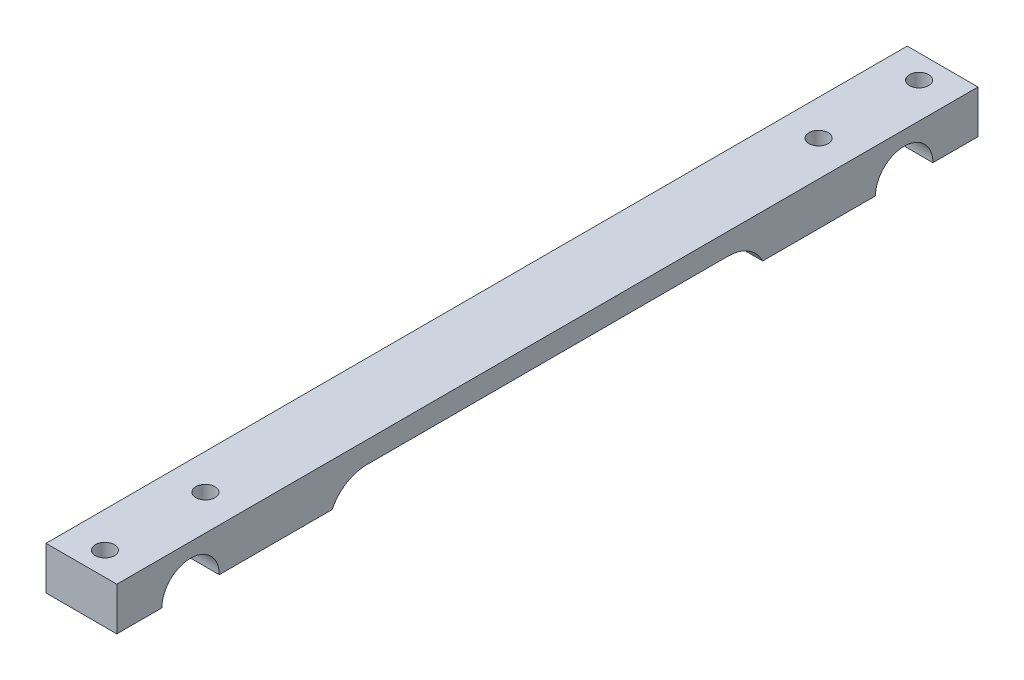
ISO-10303-21;
HEADER;
FILE_DESCRIPTION(('STEP AP214'),'2;1');
FILE_NAME('part.step','',(''),(''),'','','');
FILE_SCHEMA(('AUTOMOTIVE_DESIGN { 1 0 10303 214 1 1 1 1 }'));
ENDSEC;
DATA;
#1=APPLICATION_CONTEXT('core data for automotive mechanical design processes');
#2=APPLICATION_PROTOCOL_DEFINITION('international standard','automotive_design',2000,#1);
#3=PRODUCT_CONTEXT('',#1,'mechanical');
#4=PRODUCT('Part','Part','',(#3));
#5=PRODUCT_RELATED_PRODUCT_CATEGORY('part','',(#4));
#6=PRODUCT_DEFINITION_FORMATION('','',#4);
#7=PRODUCT_DEFINITION_CONTEXT('part definition',#1,'design');
#8=PRODUCT_DEFINITION('design','',#6,#7);
#9=PRODUCT_DEFINITION_SHAPE('','',#8);
#10=(LENGTH_UNIT() NAMED_UNIT(*) SI_UNIT(.MILLI.,.METRE.));
#11=(NAMED_UNIT(*) PLANE_ANGLE_UNIT() SI_UNIT($,.RADIAN.));
#12=(NAMED_UNIT(*) SI_UNIT($,.STERADIAN.) SOLID_ANGLE_UNIT());
#13=UNCERTAINTY_MEASURE_WITH_UNIT(LENGTH_MEASURE(1.E-05),#10,'distance_accuracy_value','');
#14=(GEOMETRIC_REPRESENTATION_CONTEXT(3) GLOBAL_UNCERTAINTY_ASSIGNED_CONTEXT((#13)) GLOBAL_UNIT_ASSIGNED_CONTEXT((#10,
#11,#12)) REPRESENTATION_CONTEXT('',''));
#15=CARTESIAN_POINT('',(0.,0.,0.));
#16=DIRECTION('',(0.,0.,1.));
#17=DIRECTION('',(1.,0.,0.));
#18=AXIS2_PLACEMENT_3D('',#15,#16,#17);
#19=CARTESIAN_POINT('',(14.8,-4.5,90.));
#20=DIRECTION('',(0.,1.,0.));
#21=DIRECTION('',(0.,0.,1.));
#22=AXIS2_PLACEMENT_3D('',#19,#20,#21);
#23=PLANE('',#22);
#24=CARTESIAN_POINT('',(7.40000000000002,-4.5,64.079));
#25=DIRECTION('',(0.,1.,0.));
#26=DIRECTION('',(0.,0.,1.));
#27=AXIS2_PLACEMENT_3D('',#24,#25,#26);
#28=CIRCLE('',#27,2.);
#29=CARTESIAN_POINT('',(7.40000000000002,-4.5,66.079));
#30=VERTEX_POINT('',#29);
#31=EDGE_CURVE('E153',#30,#30,#28,.T.);
#32=ORIENTED_EDGE('',*,*,#31,.T.);
#33=EDGE_LOOP('',(#32));
#34=FACE_BOUND('',#33,.T.);
#35=DIRECTION('',(0.,0.,-1.));
#36=VECTOR('',#35,1.);
#37=CARTESIAN_POINT('',(0.,-4.5,90.));
#38=LINE('',#37,#36);
#39=CARTESIAN_POINT('',(0.,-4.5,68.579));
#40=VERTEX_POINT('',#39);
#41=CARTESIAN_POINT('',(0.,-4.5,45.));
#42=VERTEX_POINT('',#41);
#43=EDGE_CURVE('E129',#40,#42,#38,.T.);
#44=ORIENTED_EDGE('',*,*,#43,.T.);
#45=DIRECTION('',(1.,0.,0.));
#46=VECTOR('',#45,1.);
#47=CARTESIAN_POINT('',(0.,-4.5,45.));
#48=LINE('',#47,#46);
#49=CARTESIAN_POINT('',(14.8,-4.5,45.));
#50=VERTEX_POINT('',#49);
#51=EDGE_CURVE('E137',#42,#50,#48,.T.);
#52=ORIENTED_EDGE('',*,*,#51,.T.);
#53=DIRECTION('',(0.,0.,-1.));
#54=VECTOR('',#53,1.);
#55=CARTESIAN_POINT('',(14.8,-4.5,90.));
#56=LINE('',#55,#54);
#57=CARTESIAN_POINT('',(14.8,-4.5,68.579));
#58=VERTEX_POINT('',#57);
#59=EDGE_CURVE('E208',#58,#50,#56,.T.);
#60=ORIENTED_EDGE('',*,*,#59,.F.);
#61=DIRECTION('',(1.,0.,0.));
#62=VECTOR('',#61,1.);
#63=CARTESIAN_POINT('',(0.,-4.5,68.579));
#64=LINE('',#63,#62);
#65=EDGE_CURVE('E139',#40,#58,#64,.T.);
#66=ORIENTED_EDGE('',*,*,#65,.F.);
#67=EDGE_LOOP('',(#44,#52,#60,#66));
#68=FACE_BOUND('',#67,.T.);
#69=ADVANCED_FACE('F37',(#34,#68),#23,.F.);
#70=CARTESIAN_POINT('',(7.40000000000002,-4.5,85.079));
#71=DIRECTION('',(0.,1.,0.));
#72=DIRECTION('',(0.,0.,1.));
#73=AXIS2_PLACEMENT_3D('',#70,#71,#72);
#74=CIRCLE('',#73,2.);
#75=CARTESIAN_POINT('',(7.40000000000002,-4.5,87.079));
#76=VERTEX_POINT('',#75);
#77=EDGE_CURVE('E160',#76,#76,#74,.T.);
#78=ORIENTED_EDGE('',*,*,#77,.T.);
#79=EDGE_LOOP('',(#78));
#80=FACE_BOUND('',#79,.T.);
#81=CARTESIAN_POINT('',(0.,-4.5,90.));
#82=VERTEX_POINT('',#81);
#83=CARTESIAN_POINT('',(0.,-4.5,80.579));
#84=VERTEX_POINT('',#83);
#85=EDGE_CURVE('E140',#82,#84,#38,.T.);
#86=ORIENTED_EDGE('',*,*,#85,.T.);
#87=DIRECTION('',(1.,0.,0.));
#88=VECTOR('',#87,1.);
#89=CARTESIAN_POINT('',(0.,-4.5,80.579));
#90=LINE('',#89,#88);
#91=CARTESIAN_POINT('',(14.8,-4.5,80.579));
#92=VERTEX_POINT('',#91);
#93=EDGE_CURVE('E182',#84,#92,#90,.T.);
#94=ORIENTED_EDGE('',*,*,#93,.T.);
#95=CARTESIAN_POINT('',(14.8,-4.5,90.));
#96=VERTEX_POINT('',#95);
#97=EDGE_CURVE('E204',#96,#92,#56,.T.);
#98=ORIENTED_EDGE('',*,*,#97,.F.);
#99=DIRECTION('',(-1.,0.,0.));
#100=VECTOR('',#99,1.);
#101=CARTESIAN_POINT('',(14.8,-4.5,90.));
#102=LINE('',#101,#100);
#103=EDGE_CURVE('E219',#96,#82,#102,.T.);
#104=ORIENTED_EDGE('',*,*,#103,.T.);
#105=EDGE_LOOP('',(#86,#94,#98,#104));
#106=FACE_BOUND('',#105,.T.);
#107=ADVANCED_FACE('F269',(#80,#106),#23,.F.);
#108=CARTESIAN_POINT('',(7.40000000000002,-4.5,-64.079));
#109=DIRECTION('',(0.,1.,0.));
#110=DIRECTION('',(0.,0.,1.));
#111=AXIS2_PLACEMENT_3D('',#108,#109,#110);
#112=CIRCLE('',#111,2.);
#113=CARTESIAN_POINT('',(7.40000000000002,-4.5,-62.079));
#114=VERTEX_POINT('',#113);
#115=EDGE_CURVE('E171',#114,#114,#112,.T.);
#116=ORIENTED_EDGE('',*,*,#115,.T.);
#117=EDGE_LOOP('',(#116));
#118=FACE_BOUND('',#117,.T.);
#119=CARTESIAN_POINT('',(14.8,-4.49999999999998,-45.));
#120=VERTEX_POINT('',#119);
#121=CARTESIAN_POINT('',(14.8,-4.5,-68.579));
#122=VERTEX_POINT('',#121);
#123=EDGE_CURVE('E209',#120,#122,#56,.T.);
#124=ORIENTED_EDGE('',*,*,#123,.F.);
#125=DIRECTION('',(1.,0.,0.));
#126=VECTOR('',#125,1.);
#127=CARTESIAN_POINT('',(0.,-4.49999999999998,-45.));
#128=LINE('',#127,#126);
#129=CARTESIAN_POINT('',(0.,-4.49999999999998,-45.));
#130=VERTEX_POINT('',#129);
#131=EDGE_CURVE('E144',#130,#120,#128,.T.);
#132=ORIENTED_EDGE('',*,*,#131,.F.);
#133=CARTESIAN_POINT('',(0.,-4.5,-68.579));
#134=VERTEX_POINT('',#133);
#135=EDGE_CURVE('E141',#130,#134,#38,.T.);
#136=ORIENTED_EDGE('',*,*,#135,.T.);
#137=DIRECTION('',(1.,0.,0.));
#138=VECTOR('',#137,1.);
#139=CARTESIAN_POINT('',(0.,-4.5,-68.579));
#140=LINE('',#139,#138);
#141=EDGE_CURVE('E174',#134,#122,#140,.T.);
#142=ORIENTED_EDGE('',*,*,#141,.T.);
#143=EDGE_LOOP('',(#124,#132,#136,#142));
#144=FACE_BOUND('',#143,.T.);
#145=ADVANCED_FACE('F245',(#118,#144),#23,.F.);
#146=CARTESIAN_POINT('',(14.8,-4.5,-90.));
#147=DIRECTION('',(0.,0.,1.));
#148=DIRECTION('',(1.,0.,0.));
#149=AXIS2_PLACEMENT_3D('',#146,#147,#148);
#150=PLANE('',#149);
#151=DIRECTION('',(0.,1.,0.));
#152=VECTOR('',#151,1.);
#153=CARTESIAN_POINT('',(0.,-4.5,-90.));
#154=LINE('',#153,#152);
#155=CARTESIAN_POINT('',(0.,-4.5,-90.));
#156=VERTEX_POINT('',#155);
#157=CARTESIAN_POINT('',(0.,4.5,-90.));
#158=VERTEX_POINT('',#157);
#159=EDGE_CURVE('E185',#156,#158,#154,.T.);
#160=ORIENTED_EDGE('',*,*,#159,.T.);
#161=DIRECTION('',(-1.,0.,0.));
#162=VECTOR('',#161,1.);
#163=CARTESIAN_POINT('',(14.8,4.5,-90.));
#164=LINE('',#163,#162);
#165=CARTESIAN_POINT('',(14.8,4.5,-90.));
#166=VERTEX_POINT('',#165);
#167=EDGE_CURVE('E225',#166,#158,#164,.T.);
#168=ORIENTED_EDGE('',*,*,#167,.F.);
#169=DIRECTION('',(0.,1.,0.));
#170=VECTOR('',#169,1.);
#171=CARTESIAN_POINT('',(14.8,-4.5,-90.));
#172=LINE('',#171,#170);
#173=CARTESIAN_POINT('',(14.8,-4.5,-90.));
#174=VERTEX_POINT('',#173);
#175=EDGE_CURVE('E196',#174,#166,#172,.T.);
#176=ORIENTED_EDGE('',*,*,#175,.F.);
#177=DIRECTION('',(-1.,0.,0.));
#178=VECTOR('',#177,1.);
#179=CARTESIAN_POINT('',(14.8,-4.5,-90.));
#180=LINE('',#179,#178);
#181=EDGE_CURVE('E207',#174,#156,#180,.T.);
#182=ORIENTED_EDGE('',*,*,#181,.T.);
#183=EDGE_LOOP('',(#160,#168,#176,#182));
#184=FACE_BOUND('',#183,.T.);
#185=ADVANCED_FACE('F257',(#184),#150,.F.);
#186=CARTESIAN_POINT('',(14.8,4.5,90.));
#187=DIRECTION('',(0.,-1.,0.));
#188=DIRECTION('',(0.,0.,-1.));
#189=AXIS2_PLACEMENT_3D('',#186,#187,#188);
#190=PLANE('',#189);
#191=CARTESIAN_POINT('',(7.40000000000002,4.5,-85.079));
#192=DIRECTION('',(0.,1.,0.));
#193=DIRECTION('',(0.,0.,1.));
#194=AXIS2_PLACEMENT_3D('',#191,#192,#193);
#195=CIRCLE('',#194,2.);
#196=CARTESIAN_POINT('',(7.40000000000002,4.5,-83.079));
#197=VERTEX_POINT('',#196);
#198=EDGE_CURVE('E147',#197,#197,#195,.T.);
#199=ORIENTED_EDGE('',*,*,#198,.F.);
#200=EDGE_LOOP('',(#199));
#201=FACE_BOUND('',#200,.T.);
#202=CARTESIAN_POINT('',(7.40000000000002,4.5,85.079));
#203=DIRECTION('',(0.,1.,0.));
#204=DIRECTION('',(0.,0.,1.));
#205=AXIS2_PLACEMENT_3D('',#202,#203,#204);
#206=CIRCLE('',#205,2.);
#207=CARTESIAN_POINT('',(7.40000000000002,4.5,87.079));
#208=VERTEX_POINT('',#207);
#209=EDGE_CURVE('E163',#208,#208,#206,.T.);
#210=ORIENTED_EDGE('',*,*,#209,.F.);
#211=EDGE_LOOP('',(#210));
#212=FACE_BOUND('',#211,.T.);
#213=CARTESIAN_POINT('',(7.40000000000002,4.5,64.079));
#214=DIRECTION('',(0.,1.,0.));
#215=DIRECTION('',(0.,0.,1.));
#216=AXIS2_PLACEMENT_3D('',#213,#214,#215);
#217=CIRCLE('',#216,2.);
#218=CARTESIAN_POINT('',(7.40000000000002,4.5,66.079));
#219=VERTEX_POINT('',#218);
#220=EDGE_CURVE('E157',#219,#219,#217,.T.);
#221=ORIENTED_EDGE('',*,*,#220,.F.);
#222=EDGE_LOOP('',(#221));
#223=FACE_BOUND('',#222,.T.);
#224=CARTESIAN_POINT('',(7.40000000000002,4.5,-64.079));
#225=DIRECTION('',(0.,1.,0.));
#226=DIRECTION('',(0.,0.,1.));
#227=AXIS2_PLACEMENT_3D('',#224,#225,#226);
#228=CIRCLE('',#227,2.);
#229=CARTESIAN_POINT('',(7.40000000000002,4.5,-62.079));
#230=VERTEX_POINT('',#229);
#231=EDGE_CURVE('E156',#230,#230,#228,.T.);
#232=ORIENTED_EDGE('',*,*,#231,.F.);
#233=EDGE_LOOP('',(#232));
#234=FACE_BOUND('',#233,.T.);
#235=DIRECTION('',(0.,0.,1.));
#236=VECTOR('',#235,1.);
#237=CARTESIAN_POINT('',(0.,4.5,90.));
#238=LINE('',#237,#236);
#239=CARTESIAN_POINT('',(0.,4.5,90.));
#240=VERTEX_POINT('',#239);
#241=EDGE_CURVE('E212',#158,#240,#238,.T.);
#242=ORIENTED_EDGE('',*,*,#241,.T.);
#243=DIRECTION('',(-1.,0.,0.));
#244=VECTOR('',#243,1.);
#245=CARTESIAN_POINT('',(14.8,4.5,90.));
#246=LINE('',#245,#244);
#247=CARTESIAN_POINT('',(14.8,4.5,90.));
#248=VERTEX_POINT('',#247);
#249=EDGE_CURVE('E222',#248,#240,#246,.T.);
#250=ORIENTED_EDGE('',*,*,#249,.F.);
#251=DIRECTION('',(0.,0.,1.));
#252=VECTOR('',#251,1.);
#253=CARTESIAN_POINT('',(14.8,4.5,90.));
#254=LINE('',#253,#252);
#255=EDGE_CURVE('E199',#166,#248,#254,.T.);
#256=ORIENTED_EDGE('',*,*,#255,.F.);
#257=ORIENTED_EDGE('',*,*,#167,.T.);
#258=EDGE_LOOP('',(#242,#250,#256,#257));
#259=FACE_BOUND('',#258,.T.);
#260=ADVANCED_FACE('F259',(#201,#212,#223,#234,#259),#190,.F.);
#261=CARTESIAN_POINT('',(14.8,-4.5,90.));
#262=DIRECTION('',(0.,0.,-1.));
#263=DIRECTION('',(-1.,0.,0.));
#264=AXIS2_PLACEMENT_3D('',#261,#262,#263);
#265=PLANE('',#264);
#266=DIRECTION('',(0.,-1.,0.));
#267=VECTOR('',#266,1.);
#268=CARTESIAN_POINT('',(0.,-4.5,90.));
#269=LINE('',#268,#267);
#270=EDGE_CURVE('E214',#240,#82,#269,.T.);
#271=ORIENTED_EDGE('',*,*,#270,.T.);
#272=ORIENTED_EDGE('',*,*,#103,.F.);
#273=DIRECTION('',(0.,-1.,0.));
#274=VECTOR('',#273,1.);
#275=CARTESIAN_POINT('',(14.8,-4.5,90.));
#276=LINE('',#275,#274);
#277=EDGE_CURVE('E201',#248,#96,#276,.T.);
#278=ORIENTED_EDGE('',*,*,#277,.F.);
#279=ORIENTED_EDGE('',*,*,#249,.T.);
#280=EDGE_LOOP('',(#271,#272,#278,#279));
#281=FACE_BOUND('',#280,.T.);
#282=ADVANCED_FACE('F265',(#281),#265,.F.);
#283=CARTESIAN_POINT('',(7.40000000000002,-4.5,-85.079));
#284=DIRECTION('',(0.,1.,0.));
#285=DIRECTION('',(0.,0.,1.));
#286=AXIS2_PLACEMENT_3D('',#283,#284,#285);
#287=CIRCLE('',#286,2.);
#288=CARTESIAN_POINT('',(7.40000000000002,-4.5,-83.079));
#289=VERTEX_POINT('',#288);
#290=EDGE_CURVE('E166',#289,#289,#287,.T.);
#291=ORIENTED_EDGE('',*,*,#290,.T.);
#292=EDGE_LOOP('',(#291));
#293=FACE_BOUND('',#292,.T.);
#294=CARTESIAN_POINT('',(14.8,-4.5,-80.579));
#295=VERTEX_POINT('',#294);
#296=EDGE_CURVE('E203',#295,#174,#56,.T.);
#297=ORIENTED_EDGE('',*,*,#296,.F.);
#298=DIRECTION('',(1.,0.,0.));
#299=VECTOR('',#298,1.);
#300=CARTESIAN_POINT('',(0.,-4.5,-80.579));
#301=LINE('',#300,#299);
#302=CARTESIAN_POINT('',(0.,-4.5,-80.579));
#303=VERTEX_POINT('',#302);
#304=EDGE_CURVE('E187',#303,#295,#301,.T.);
#305=ORIENTED_EDGE('',*,*,#304,.F.);
#306=EDGE_CURVE('E143',#303,#156,#38,.T.);
#307=ORIENTED_EDGE('',*,*,#306,.T.);
#308=ORIENTED_EDGE('',*,*,#181,.F.);
#309=EDGE_LOOP('',(#297,#305,#307,#308));
#310=FACE_BOUND('',#309,.T.);
#311=ADVANCED_FACE('F253',(#293,#310),#23,.F.);
#312=CARTESIAN_POINT('',(14.8,0.,0.));
#313=DIRECTION('',(-1.,0.,0.));
#314=DIRECTION('',(0.,0.,1.));
#315=AXIS2_PLACEMENT_3D('',#312,#313,#314);
#316=PLANE('',#315);
#317=ORIENTED_EDGE('',*,*,#59,.T.);
#318=CARTESIAN_POINT('',(14.8,-8.,37.8062527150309));
#319=DIRECTION('',(-1.,0.,0.));
#320=DIRECTION('',(0.,0.,1.));
#321=AXIS2_PLACEMENT_3D('',#318,#319,#320);
#322=CIRCLE('',#321,8.);
#323=CARTESIAN_POINT('',(14.8,0.,37.8062527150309));
#324=VERTEX_POINT('',#323);
#325=EDGE_CURVE('E45',#50,#324,#322,.T.);
#326=ORIENTED_EDGE('',*,*,#325,.T.);
#327=DIRECTION('',(0.,0.,1.));
#328=VECTOR('',#327,1.);
#329=CARTESIAN_POINT('',(14.8,0.,45.));
#330=LINE('',#329,#328);
#331=CARTESIAN_POINT('',(14.8,0.,-37.8062527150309));
#332=VERTEX_POINT('',#331);
#333=EDGE_CURVE('E149',#332,#324,#330,.T.);
#334=ORIENTED_EDGE('',*,*,#333,.F.);
#335=CARTESIAN_POINT('',(14.8,-7.99999999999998,-37.8062527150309));
#336=DIRECTION('',(-1.,0.,0.));
#337=DIRECTION('',(0.,0.,1.));
#338=AXIS2_PLACEMENT_3D('',#335,#336,#337);
#339=CIRCLE('',#338,8.);
#340=EDGE_CURVE('E232',#332,#120,#339,.T.);
#341=ORIENTED_EDGE('',*,*,#340,.T.);
#342=ORIENTED_EDGE('',*,*,#123,.T.);
#343=CARTESIAN_POINT('',(14.8,-4.5,-74.579));
#344=DIRECTION('',(1.,0.,0.));
#345=DIRECTION('',(0.,0.,-1.));
#346=AXIS2_PLACEMENT_3D('',#343,#344,#345);
#347=CIRCLE('',#346,6.00000000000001);
#348=EDGE_CURVE('E181',#295,#122,#347,.T.);
#349=ORIENTED_EDGE('',*,*,#348,.F.);
#350=ORIENTED_EDGE('',*,*,#296,.T.);
#351=ORIENTED_EDGE('',*,*,#175,.T.);
#352=ORIENTED_EDGE('',*,*,#255,.T.);
#353=ORIENTED_EDGE('',*,*,#277,.T.);
#354=ORIENTED_EDGE('',*,*,#97,.T.);
#355=CARTESIAN_POINT('',(14.8,-4.5,74.579));
#356=DIRECTION('',(1.,0.,0.));
#357=DIRECTION('',(0.,0.,-1.));
#358=AXIS2_PLACEMENT_3D('',#355,#356,#357);
#359=CIRCLE('',#358,6.00000000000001);
#360=EDGE_CURVE('E179',#58,#92,#359,.T.);
#361=ORIENTED_EDGE('',*,*,#360,.F.);
#362=EDGE_LOOP('',(#317,#326,#334,#341,#342,#349,#350,#351,#352,#353,#354,#361));
#363=FACE_BOUND('',#362,.T.);
#364=ADVANCED_FACE('F236',(#363),#316,.F.);
#365=CARTESIAN_POINT('',(0.,0.,0.));
#366=DIRECTION('',(-1.,0.,0.));
#367=DIRECTION('',(0.,0.,1.));
#368=AXIS2_PLACEMENT_3D('',#365,#366,#367);
#369=PLANE('',#368);
#370=DIRECTION('',(0.,0.,1.));
#371=VECTOR('',#370,1.);
#372=CARTESIAN_POINT('',(0.,0.,45.));
#373=LINE('',#372,#371);
#374=CARTESIAN_POINT('',(0.,0.,-37.8062527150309));
#375=VERTEX_POINT('',#374);
#376=CARTESIAN_POINT('',(0.,0.,37.8062527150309));
#377=VERTEX_POINT('',#376);
#378=EDGE_CURVE('E130',#375,#377,#373,.T.);
#379=ORIENTED_EDGE('',*,*,#378,.T.);
#380=CARTESIAN_POINT('',(0.,-8.,37.8062527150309));
#381=DIRECTION('',(-1.,0.,0.));
#382=DIRECTION('',(0.,0.,1.));
#383=AXIS2_PLACEMENT_3D('',#380,#381,#382);
#384=CIRCLE('',#383,8.);
#385=EDGE_CURVE('E11',#377,#42,#384,.F.);
#386=ORIENTED_EDGE('',*,*,#385,.T.);
#387=ORIENTED_EDGE('',*,*,#43,.F.);
#388=CARTESIAN_POINT('',(0.,-4.5,74.579));
#389=DIRECTION('',(1.,0.,0.));
#390=DIRECTION('',(0.,0.,-1.));
#391=AXIS2_PLACEMENT_3D('',#388,#389,#390);
#392=CIRCLE('',#391,6.00000000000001);
#393=EDGE_CURVE('E177',#40,#84,#392,.T.);
#394=ORIENTED_EDGE('',*,*,#393,.T.);
#395=ORIENTED_EDGE('',*,*,#85,.F.);
#396=ORIENTED_EDGE('',*,*,#270,.F.);
#397=ORIENTED_EDGE('',*,*,#241,.F.);
#398=ORIENTED_EDGE('',*,*,#159,.F.);
#399=ORIENTED_EDGE('',*,*,#306,.F.);
#400=CARTESIAN_POINT('',(0.,-4.5,-74.579));
#401=DIRECTION('',(1.,0.,0.));
#402=DIRECTION('',(0.,0.,-1.));
#403=AXIS2_PLACEMENT_3D('',#400,#401,#402);
#404=CIRCLE('',#403,6.00000000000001);
#405=EDGE_CURVE('E189',#303,#134,#404,.T.);
#406=ORIENTED_EDGE('',*,*,#405,.T.);
#407=ORIENTED_EDGE('',*,*,#135,.F.);
#408=CARTESIAN_POINT('',(0.,-7.99999999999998,-37.8062527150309));
#409=DIRECTION('',(-1.,0.,0.));
#410=DIRECTION('',(0.,0.,1.));
#411=AXIS2_PLACEMENT_3D('',#408,#409,#410);
#412=CIRCLE('',#411,8.);
#413=EDGE_CURVE('E59',#130,#375,#412,.F.);
#414=ORIENTED_EDGE('',*,*,#413,.T.);
#415=EDGE_LOOP('',(#379,#386,#387,#394,#395,#396,#397,#398,#399,#406,#407,#414));
#416=FACE_BOUND('',#415,.T.);
#417=ADVANCED_FACE('F127',(#416),#369,.T.);
#418=CARTESIAN_POINT('',(0.,-4.5,-74.579));
#419=DIRECTION('',(1.,0.,0.));
#420=DIRECTION('',(0.,0.,-1.));
#421=AXIS2_PLACEMENT_3D('',#418,#419,#420);
#422=CYLINDRICAL_SURFACE('',#421,6.00000000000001);
#423=ORIENTED_EDGE('',*,*,#348,.T.);
#424=ORIENTED_EDGE('',*,*,#141,.F.);
#425=ORIENTED_EDGE('',*,*,#405,.F.);
#426=ORIENTED_EDGE('',*,*,#304,.T.);
#427=EDGE_LOOP('',(#423,#424,#425,#426));
#428=FACE_BOUND('',#427,.T.);
#429=ADVANCED_FACE('F273',(#428),#422,.F.);
#430=CARTESIAN_POINT('',(0.,-4.5,74.579));
#431=DIRECTION('',(1.,0.,0.));
#432=DIRECTION('',(0.,0.,-1.));
#433=AXIS2_PLACEMENT_3D('',#430,#431,#432);
#434=CYLINDRICAL_SURFACE('',#433,6.00000000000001);
#435=ORIENTED_EDGE('',*,*,#360,.T.);
#436=ORIENTED_EDGE('',*,*,#93,.F.);
#437=ORIENTED_EDGE('',*,*,#393,.F.);
#438=ORIENTED_EDGE('',*,*,#65,.T.);
#439=EDGE_LOOP('',(#435,#436,#437,#438));
#440=FACE_BOUND('',#439,.T.);
#441=ADVANCED_FACE('F271',(#440),#434,.F.);
#442=CARTESIAN_POINT('',(7.40000000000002,-4.5,-85.079));
#443=DIRECTION('',(0.,1.,0.));
#444=DIRECTION('',(0.,0.,1.));
#445=AXIS2_PLACEMENT_3D('',#442,#443,#444);
#446=CYLINDRICAL_SURFACE('',#445,2.);
#447=ORIENTED_EDGE('',*,*,#290,.F.);
#448=EDGE_LOOP('',(#447));
#449=FACE_BOUND('',#448,.T.);
#450=ORIENTED_EDGE('',*,*,#198,.T.);
#451=EDGE_LOOP('',(#450));
#452=FACE_BOUND('',#451,.T.);
#453=ADVANCED_FACE('F280',(#449,#452),#446,.F.);
#454=CARTESIAN_POINT('',(7.40000000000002,-4.5,-64.079));
#455=DIRECTION('',(0.,1.,0.));
#456=DIRECTION('',(0.,0.,1.));
#457=AXIS2_PLACEMENT_3D('',#454,#455,#456);
#458=CYLINDRICAL_SURFACE('',#457,2.);
#459=ORIENTED_EDGE('',*,*,#115,.F.);
#460=EDGE_LOOP('',(#459));
#461=FACE_BOUND('',#460,.T.);
#462=ORIENTED_EDGE('',*,*,#231,.T.);
#463=EDGE_LOOP('',(#462));
#464=FACE_BOUND('',#463,.T.);
#465=ADVANCED_FACE('F306',(#461,#464),#458,.F.);
#466=CARTESIAN_POINT('',(7.40000000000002,-4.5,64.079));
#467=DIRECTION('',(0.,1.,0.));
#468=DIRECTION('',(0.,0.,1.));
#469=AXIS2_PLACEMENT_3D('',#466,#467,#468);
#470=CYLINDRICAL_SURFACE('',#469,2.);
#471=ORIENTED_EDGE('',*,*,#31,.F.);
#472=EDGE_LOOP('',(#471));
#473=FACE_BOUND('',#472,.T.);
#474=ORIENTED_EDGE('',*,*,#220,.T.);
#475=EDGE_LOOP('',(#474));
#476=FACE_BOUND('',#475,.T.);
#477=ADVANCED_FACE('F309',(#473,#476),#470,.F.);
#478=CARTESIAN_POINT('',(7.40000000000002,-4.5,85.079));
#479=DIRECTION('',(0.,1.,0.));
#480=DIRECTION('',(0.,0.,1.));
#481=AXIS2_PLACEMENT_3D('',#478,#479,#480);
#482=CYLINDRICAL_SURFACE('',#481,2.);
#483=ORIENTED_EDGE('',*,*,#77,.F.);
#484=EDGE_LOOP('',(#483));
#485=FACE_BOUND('',#484,.T.);
#486=ORIENTED_EDGE('',*,*,#209,.T.);
#487=EDGE_LOOP('',(#486));
#488=FACE_BOUND('',#487,.T.);
#489=ADVANCED_FACE('F325',(#485,#488),#482,.F.);
#490=CARTESIAN_POINT('',(0.,0.,45.));
#491=DIRECTION('',(0.,1.,0.));
#492=DIRECTION('',(0.,0.,1.));
#493=AXIS2_PLACEMENT_3D('',#490,#491,#492);
#494=PLANE('',#493);
#495=ORIENTED_EDGE('',*,*,#378,.F.);
#496=DIRECTION('',(1.,0.,0.));
#497=VECTOR('',#496,1.);
#498=CARTESIAN_POINT('',(0.,0.,-37.8062527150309));
#499=LINE('',#498,#497);
#500=EDGE_CURVE('E229',#375,#332,#499,.T.);
#501=ORIENTED_EDGE('',*,*,#500,.T.);
#502=ORIENTED_EDGE('',*,*,#333,.T.);
#503=DIRECTION('',(-1.,0.,0.));
#504=VECTOR('',#503,1.);
#505=CARTESIAN_POINT('',(0.,0.,37.8062527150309));
#506=LINE('',#505,#504);
#507=EDGE_CURVE('E52',#324,#377,#506,.T.);
#508=ORIENTED_EDGE('',*,*,#507,.T.);
#509=EDGE_LOOP('',(#495,#501,#502,#508));
#510=FACE_BOUND('',#509,.T.);
#511=ADVANCED_FACE('F238',(#510),#494,.F.);
#512=CARTESIAN_POINT('',(0.,-7.99999999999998,-37.8062527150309));
#513=DIRECTION('',(1.,0.,0.));
#514=DIRECTION('',(0.,0.,-1.));
#515=AXIS2_PLACEMENT_3D('',#512,#513,#514);
#516=CYLINDRICAL_SURFACE('',#515,8.);
#517=ORIENTED_EDGE('',*,*,#413,.F.);
#518=ORIENTED_EDGE('',*,*,#131,.T.);
#519=ORIENTED_EDGE('',*,*,#340,.F.);
#520=ORIENTED_EDGE('',*,*,#500,.F.);
#521=EDGE_LOOP('',(#517,#518,#519,#520));
#522=FACE_BOUND('',#521,.T.);
#523=ADVANCED_FACE('F241',(#522),#516,.F.);
#524=CARTESIAN_POINT('',(0.,-8.,37.8062527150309));
#525=DIRECTION('',(-1.,0.,0.));
#526=DIRECTION('',(0.,0.,1.));
#527=AXIS2_PLACEMENT_3D('',#524,#525,#526);
#528=CYLINDRICAL_SURFACE('',#527,8.);
#529=ORIENTED_EDGE('',*,*,#385,.F.);
#530=ORIENTED_EDGE('',*,*,#507,.F.);
#531=ORIENTED_EDGE('',*,*,#325,.F.);
#532=ORIENTED_EDGE('',*,*,#51,.F.);
#533=EDGE_LOOP('',(#529,#530,#531,#532));
#534=FACE_BOUND('',#533,.T.);
#535=ADVANCED_FACE('F39',(#534),#528,.F.);
#536=CLOSED_SHELL('',(#69,#107,#145,#185,#260,#282,#311,#364,#417,#429,#441,#453,#465,#477,#489,
#511,#523,#535));
#537=MANIFOLD_SOLID_BREP('B2',#536);
#538=ADVANCED_BREP_SHAPE_REPRESENTATION('',(#18,#537),#14);
#539=SHAPE_DEFINITION_REPRESENTATION(#9,#538);
ENDSEC;
END-ISO-10303-21;
